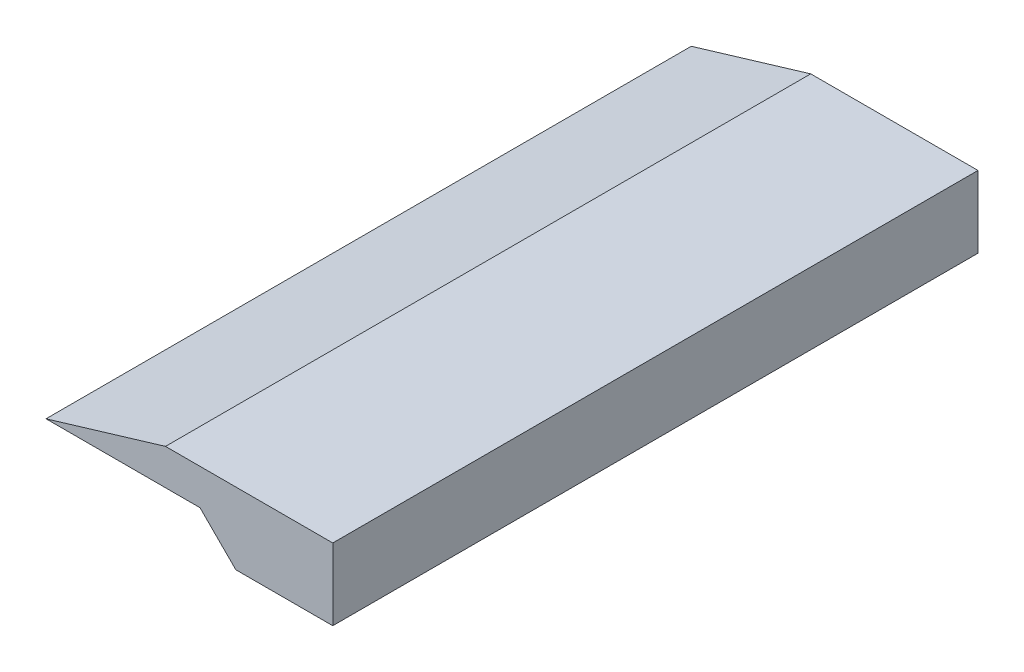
from build123d import *

# Parameters (mm, degrees)
BASE_EXTRUDE_DEPTH = 27
CUT_EXTRUDE1_DEPTH = 226.755413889


with BuildPart() as part:
    # Sketch2 → Base-Extrude (new body)
    with BuildSketch(Plane.XY):
        Polygon((-212.13, 1.5), (-219.13, 1.5), (-224.13, 0), (-219.13, -1.5), (-212.13, -1.5), align=None)
    extrude(amount=-BASE_EXTRUDE_DEPTH)

    # Sketch3 → Cut-Extrude1 (cut, through all)
    with BuildSketch(Plane.XY):
        Polygon((-224.13, 0), (-217.686656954, 0), (-216.186656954, -1.5), (-224.13, -1.5), align=None)
    extrude(amount=-CUT_EXTRUDE1_DEPTH, mode=Mode.SUBTRACT)


solid = part.part
